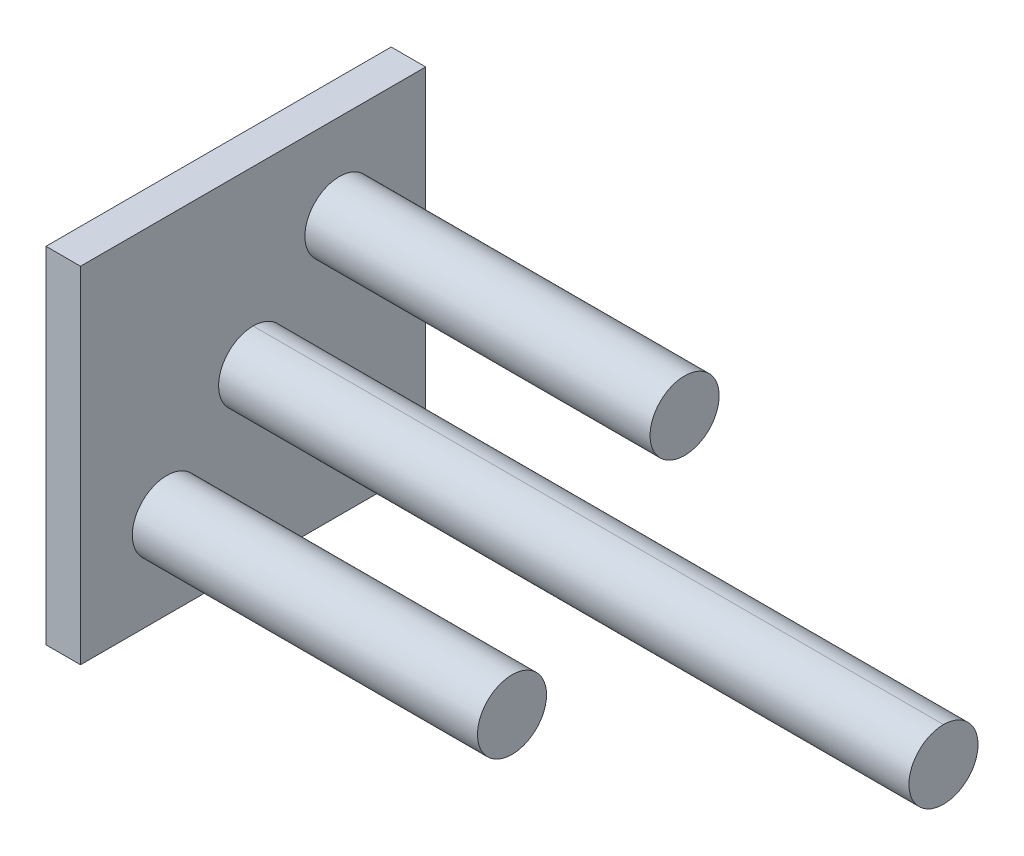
ISO-10303-21;
HEADER;
FILE_DESCRIPTION(('STEP AP214'),'2;1');
FILE_NAME('part.step','',(''),(''),'','','');
FILE_SCHEMA(('AUTOMOTIVE_DESIGN { 1 0 10303 214 1 1 1 1 }'));
ENDSEC;
DATA;
#1=APPLICATION_CONTEXT('core data for automotive mechanical design processes');
#2=APPLICATION_PROTOCOL_DEFINITION('international standard','automotive_design',2000,#1);
#3=PRODUCT_CONTEXT('',#1,'mechanical');
#4=PRODUCT('Part','Part','',(#3));
#5=PRODUCT_RELATED_PRODUCT_CATEGORY('part','',(#4));
#6=PRODUCT_DEFINITION_FORMATION('','',#4);
#7=PRODUCT_DEFINITION_CONTEXT('part definition',#1,'design');
#8=PRODUCT_DEFINITION('design','',#6,#7);
#9=PRODUCT_DEFINITION_SHAPE('','',#8);
#10=(LENGTH_UNIT() NAMED_UNIT(*) SI_UNIT(.MILLI.,.METRE.));
#11=(NAMED_UNIT(*) PLANE_ANGLE_UNIT() SI_UNIT($,.RADIAN.));
#12=(NAMED_UNIT(*) SI_UNIT($,.STERADIAN.) SOLID_ANGLE_UNIT());
#13=UNCERTAINTY_MEASURE_WITH_UNIT(LENGTH_MEASURE(1.E-05),#10,'distance_accuracy_value','');
#14=(GEOMETRIC_REPRESENTATION_CONTEXT(3) GLOBAL_UNCERTAINTY_ASSIGNED_CONTEXT((#13)) GLOBAL_UNIT_ASSIGNED_CONTEXT((#10,
#11,#12)) REPRESENTATION_CONTEXT('',''));
#15=CARTESIAN_POINT('',(0.,0.,0.));
#16=DIRECTION('',(0.,0.,1.));
#17=DIRECTION('',(1.,0.,0.));
#18=AXIS2_PLACEMENT_3D('',#15,#16,#17);
#19=CARTESIAN_POINT('',(42.,0.,0.));
#20=DIRECTION('',(-1.,0.,0.));
#21=DIRECTION('',(0.,0.,1.));
#22=AXIS2_PLACEMENT_3D('',#19,#20,#21);
#23=CYLINDRICAL_SURFACE('',#22,2.);
#24=CARTESIAN_POINT('',(42.,0.,0.));
#25=DIRECTION('',(1.,0.,0.));
#26=DIRECTION('',(0.,0.,-1.));
#27=AXIS2_PLACEMENT_3D('',#24,#25,#26);
#28=CIRCLE('',#27,2.);
#29=CARTESIAN_POINT('',(42.,-2.,0.));
#30=VERTEX_POINT('',#29);
#31=CARTESIAN_POINT('',(42.,2.,0.));
#32=VERTEX_POINT('',#31);
#33=EDGE_CURVE('E82',#30,#32,#28,.T.);
#34=ORIENTED_EDGE('',*,*,#33,.F.);
#35=DIRECTION('',(-1.,0.,0.));
#36=VECTOR('',#35,1.);
#37=CARTESIAN_POINT('',(42.,-2.,0.));
#38=LINE('',#37,#36);
#39=CARTESIAN_POINT('',(2.,-2.,0.));
#40=VERTEX_POINT('',#39);
#41=EDGE_CURVE('E12',#30,#40,#38,.T.);
#42=ORIENTED_EDGE('',*,*,#41,.T.);
#43=CARTESIAN_POINT('',(2.,0.,0.));
#44=DIRECTION('',(1.,0.,0.));
#45=DIRECTION('',(0.,0.,-1.));
#46=AXIS2_PLACEMENT_3D('',#43,#44,#45);
#47=CIRCLE('',#46,2.);
#48=CARTESIAN_POINT('',(2.,2.,0.));
#49=VERTEX_POINT('',#48);
#50=EDGE_CURVE('E89',#40,#49,#47,.T.);
#51=ORIENTED_EDGE('',*,*,#50,.T.);
#52=DIRECTION('',(1.,0.,0.));
#53=VECTOR('',#52,1.);
#54=CARTESIAN_POINT('',(42.,2.,0.));
#55=LINE('',#54,#53);
#56=EDGE_CURVE('E65',#49,#32,#55,.T.);
#57=ORIENTED_EDGE('',*,*,#56,.T.);
#58=EDGE_LOOP('',(#34,#42,#51,#57));
#59=FACE_BOUND('',#58,.T.);
#60=ADVANCED_FACE('F56',(#59),#23,.T.);
#61=ORIENTED_EDGE('',*,*,#41,.F.);
#62=EDGE_CURVE('E85',#32,#30,#28,.T.);
#63=ORIENTED_EDGE('',*,*,#62,.F.);
#64=ORIENTED_EDGE('',*,*,#56,.F.);
#65=EDGE_CURVE('E86',#49,#40,#47,.T.);
#66=ORIENTED_EDGE('',*,*,#65,.T.);
#67=EDGE_LOOP('',(#61,#63,#64,#66));
#68=FACE_BOUND('',#67,.T.);
#69=ADVANCED_FACE('F58',(#68),#23,.T.);
#70=CARTESIAN_POINT('',(42.,0.,0.));
#71=DIRECTION('',(1.,0.,0.));
#72=DIRECTION('',(0.,0.,-1.));
#73=AXIS2_PLACEMENT_3D('',#70,#71,#72);
#74=PLANE('',#73);
#75=ORIENTED_EDGE('',*,*,#62,.T.);
#76=ORIENTED_EDGE('',*,*,#33,.T.);
#77=EDGE_LOOP('',(#75,#76));
#78=FACE_BOUND('',#77,.T.);
#79=ADVANCED_FACE('F84',(#78),#74,.T.);
#80=CARTESIAN_POINT('',(2.,0.,0.));
#81=DIRECTION('',(1.,0.,0.));
#82=DIRECTION('',(0.,0.,-1.));
#83=AXIS2_PLACEMENT_3D('',#80,#81,#82);
#84=PLANE('',#83);
#85=ORIENTED_EDGE('',*,*,#65,.F.);
#86=ORIENTED_EDGE('',*,*,#50,.F.);
#87=EDGE_LOOP('',(#85,#86));
#88=FACE_BOUND('',#87,.T.);
#89=ADVANCED_FACE('F94',(#88),#84,.F.);
#90=CLOSED_SHELL('',(#60,#69,#79,#89));
#91=MANIFOLD_SOLID_BREP('B2',#90);
#92=CARTESIAN_POINT('',(2.,-10.,10.));
#93=DIRECTION('',(0.,0.,-1.));
#94=DIRECTION('',(0.,1.,0.));
#95=AXIS2_PLACEMENT_3D('',#92,#93,#94);
#96=PLANE('',#95);
#97=DIRECTION('',(0.,-1.,0.));
#98=VECTOR('',#97,1.);
#99=CARTESIAN_POINT('',(0.,-10.,10.));
#100=LINE('',#99,#98);
#101=CARTESIAN_POINT('',(0.,10.,10.));
#102=VERTEX_POINT('',#101);
#103=CARTESIAN_POINT('',(0.,-10.,10.));
#104=VERTEX_POINT('',#103);
#105=EDGE_CURVE('E230',#102,#104,#100,.T.);
#106=ORIENTED_EDGE('',*,*,#105,.T.);
#107=DIRECTION('',(-1.,0.,0.));
#108=VECTOR('',#107,1.);
#109=CARTESIAN_POINT('',(2.,-10.,10.));
#110=LINE('',#109,#108);
#111=CARTESIAN_POINT('',(2.,-10.,10.));
#112=VERTEX_POINT('',#111);
#113=EDGE_CURVE('E54',#112,#104,#110,.T.);
#114=ORIENTED_EDGE('',*,*,#113,.F.);
#115=DIRECTION('',(0.,-1.,0.));
#116=VECTOR('',#115,1.);
#117=CARTESIAN_POINT('',(2.,-10.,10.));
#118=LINE('',#117,#116);
#119=CARTESIAN_POINT('',(2.,10.,10.));
#120=VERTEX_POINT('',#119);
#121=EDGE_CURVE('E214',#120,#112,#118,.T.);
#122=ORIENTED_EDGE('',*,*,#121,.F.);
#123=DIRECTION('',(-1.,0.,0.));
#124=VECTOR('',#123,1.);
#125=CARTESIAN_POINT('',(2.,10.,10.));
#126=LINE('',#125,#124);
#127=EDGE_CURVE('E226',#120,#102,#126,.T.);
#128=ORIENTED_EDGE('',*,*,#127,.T.);
#129=EDGE_LOOP('',(#106,#114,#122,#128));
#130=FACE_BOUND('',#129,.T.);
#131=ADVANCED_FACE('F162',(#130),#96,.F.);
#132=CARTESIAN_POINT('',(2.,-10.,-10.));
#133=DIRECTION('',(0.,1.,0.));
#134=DIRECTION('',(0.,0.,1.));
#135=AXIS2_PLACEMENT_3D('',#132,#133,#134);
#136=PLANE('',#135);
#137=DIRECTION('',(0.,0.,-1.));
#138=VECTOR('',#137,1.);
#139=CARTESIAN_POINT('',(0.,-10.,-10.));
#140=LINE('',#139,#138);
#141=CARTESIAN_POINT('',(0.,-10.,-10.));
#142=VERTEX_POINT('',#141);
#143=EDGE_CURVE('E219',#104,#142,#140,.T.);
#144=ORIENTED_EDGE('',*,*,#143,.T.);
#145=DIRECTION('',(-1.,0.,0.));
#146=VECTOR('',#145,1.);
#147=CARTESIAN_POINT('',(2.,-10.,-10.));
#148=LINE('',#147,#146);
#149=CARTESIAN_POINT('',(2.,-10.,-10.));
#150=VERTEX_POINT('',#149);
#151=EDGE_CURVE('E171',#150,#142,#148,.T.);
#152=ORIENTED_EDGE('',*,*,#151,.F.);
#153=DIRECTION('',(0.,0.,-1.));
#154=VECTOR('',#153,1.);
#155=CARTESIAN_POINT('',(2.,-10.,-10.));
#156=LINE('',#155,#154);
#157=EDGE_CURVE('E209',#112,#150,#156,.T.);
#158=ORIENTED_EDGE('',*,*,#157,.F.);
#159=ORIENTED_EDGE('',*,*,#113,.T.);
#160=EDGE_LOOP('',(#144,#152,#158,#159));
#161=FACE_BOUND('',#160,.T.);
#162=ADVANCED_FACE('F218',(#161),#136,.F.);
#163=CARTESIAN_POINT('',(2.,10.,-10.));
#164=DIRECTION('',(0.,0.,1.));
#165=DIRECTION('',(0.,-1.,0.));
#166=AXIS2_PLACEMENT_3D('',#163,#164,#165);
#167=PLANE('',#166);
#168=DIRECTION('',(0.,1.,0.));
#169=VECTOR('',#168,1.);
#170=CARTESIAN_POINT('',(0.,10.,-10.));
#171=LINE('',#170,#169);
#172=CARTESIAN_POINT('',(0.,10.,-10.));
#173=VERTEX_POINT('',#172);
#174=EDGE_CURVE('E196',#142,#173,#171,.T.);
#175=ORIENTED_EDGE('',*,*,#174,.T.);
#176=DIRECTION('',(-1.,0.,0.));
#177=VECTOR('',#176,1.);
#178=CARTESIAN_POINT('',(2.,10.,-10.));
#179=LINE('',#178,#177);
#180=CARTESIAN_POINT('',(2.,10.,-10.));
#181=VERTEX_POINT('',#180);
#182=EDGE_CURVE('E221',#181,#173,#179,.T.);
#183=ORIENTED_EDGE('',*,*,#182,.F.);
#184=DIRECTION('',(0.,1.,0.));
#185=VECTOR('',#184,1.);
#186=CARTESIAN_POINT('',(2.,10.,-10.));
#187=LINE('',#186,#185);
#188=EDGE_CURVE('E212',#150,#181,#187,.T.);
#189=ORIENTED_EDGE('',*,*,#188,.F.);
#190=ORIENTED_EDGE('',*,*,#151,.T.);
#191=EDGE_LOOP('',(#175,#183,#189,#190));
#192=FACE_BOUND('',#191,.T.);
#193=ADVANCED_FACE('F222',(#192),#167,.F.);
#194=CARTESIAN_POINT('',(2.,10.,10.));
#195=DIRECTION('',(0.,-1.,0.));
#196=DIRECTION('',(0.,0.,-1.));
#197=AXIS2_PLACEMENT_3D('',#194,#195,#196);
#198=PLANE('',#197);
#199=DIRECTION('',(0.,0.,1.));
#200=VECTOR('',#199,1.);
#201=CARTESIAN_POINT('',(0.,10.,10.));
#202=LINE('',#201,#200);
#203=EDGE_CURVE('E202',#173,#102,#202,.T.);
#204=ORIENTED_EDGE('',*,*,#203,.T.);
#205=ORIENTED_EDGE('',*,*,#127,.F.);
#206=DIRECTION('',(0.,0.,1.));
#207=VECTOR('',#206,1.);
#208=CARTESIAN_POINT('',(2.,10.,10.));
#209=LINE('',#208,#207);
#210=EDGE_CURVE('E179',#181,#120,#209,.T.);
#211=ORIENTED_EDGE('',*,*,#210,.F.);
#212=ORIENTED_EDGE('',*,*,#182,.T.);
#213=EDGE_LOOP('',(#204,#205,#211,#212));
#214=FACE_BOUND('',#213,.T.);
#215=ADVANCED_FACE('F243',(#214),#198,.F.);
#216=CARTESIAN_POINT('',(2.,0.,0.));
#217=DIRECTION('',(-1.,0.,0.));
#218=DIRECTION('',(0.,0.,1.));
#219=AXIS2_PLACEMENT_3D('',#216,#217,#218);
#220=PLANE('',#219);
#221=ORIENTED_EDGE('',*,*,#121,.T.);
#222=ORIENTED_EDGE('',*,*,#157,.T.);
#223=ORIENTED_EDGE('',*,*,#188,.T.);
#224=ORIENTED_EDGE('',*,*,#210,.T.);
#225=EDGE_LOOP('',(#221,#222,#223,#224));
#226=FACE_BOUND('',#225,.T.);
#227=ADVANCED_FACE('F210',(#226),#220,.F.);
#228=CARTESIAN_POINT('',(0.,0.,0.));
#229=DIRECTION('',(-1.,0.,0.));
#230=DIRECTION('',(0.,0.,1.));
#231=AXIS2_PLACEMENT_3D('',#228,#229,#230);
#232=PLANE('',#231);
#233=ORIENTED_EDGE('',*,*,#105,.F.);
#234=ORIENTED_EDGE('',*,*,#203,.F.);
#235=ORIENTED_EDGE('',*,*,#174,.F.);
#236=ORIENTED_EDGE('',*,*,#143,.F.);
#237=EDGE_LOOP('',(#233,#234,#235,#236));
#238=FACE_BOUND('',#237,.T.);
#239=ADVANCED_FACE('F246',(#238),#232,.T.);
#240=CLOSED_SHELL('',(#131,#162,#193,#215,#227,#239));
#241=MANIFOLD_SOLID_BREP('B6',#240);
#242=CARTESIAN_POINT('',(22.,-5.,5.));
#243=DIRECTION('',(-1.,0.,0.));
#244=DIRECTION('',(0.,0.,1.));
#245=AXIS2_PLACEMENT_3D('',#242,#243,#244);
#246=CYLINDRICAL_SURFACE('',#245,2.);
#247=CARTESIAN_POINT('',(22.,-5.,5.));
#248=DIRECTION('',(1.,0.,0.));
#249=DIRECTION('',(0.,0.,-1.));
#250=AXIS2_PLACEMENT_3D('',#247,#248,#249);
#251=CIRCLE('',#250,2.);
#252=CARTESIAN_POINT('',(22.,-5.,3.));
#253=VERTEX_POINT('',#252);
#254=EDGE_CURVE('E161',#253,#253,#251,.T.);
#255=ORIENTED_EDGE('',*,*,#254,.F.);
#256=EDGE_LOOP('',(#255));
#257=FACE_BOUND('',#256,.T.);
#258=CARTESIAN_POINT('',(2.,-5.,5.));
#259=DIRECTION('',(1.,0.,0.));
#260=DIRECTION('',(0.,0.,-1.));
#261=AXIS2_PLACEMENT_3D('',#258,#259,#260);
#262=CIRCLE('',#261,2.);
#263=CARTESIAN_POINT('',(2.,-5.,3.));
#264=VERTEX_POINT('',#263);
#265=EDGE_CURVE('E333',#264,#264,#262,.T.);
#266=ORIENTED_EDGE('',*,*,#265,.T.);
#267=EDGE_LOOP('',(#266));
#268=FACE_BOUND('',#267,.T.);
#269=ADVANCED_FACE('F330',(#257,#268),#246,.T.);
#270=CARTESIAN_POINT('',(22.,-5.,5.));
#271=DIRECTION('',(1.,0.,0.));
#272=DIRECTION('',(0.,0.,-1.));
#273=AXIS2_PLACEMENT_3D('',#270,#271,#272);
#274=PLANE('',#273);
#275=ORIENTED_EDGE('',*,*,#254,.T.);
#276=EDGE_LOOP('',(#275));
#277=FACE_BOUND('',#276,.T.);
#278=ADVANCED_FACE('F345',(#277),#274,.T.);
#279=CARTESIAN_POINT('',(2.,-5.,5.));
#280=DIRECTION('',(1.,0.,0.));
#281=DIRECTION('',(0.,0.,-1.));
#282=AXIS2_PLACEMENT_3D('',#279,#280,#281);
#283=PLANE('',#282);
#284=ORIENTED_EDGE('',*,*,#265,.F.);
#285=EDGE_LOOP('',(#284));
#286=FACE_BOUND('',#285,.T.);
#287=ADVANCED_FACE('F343',(#286),#283,.F.);
#288=CLOSED_SHELL('',(#269,#278,#287));
#289=MANIFOLD_SOLID_BREP('B48',#288);
#290=CARTESIAN_POINT('',(22.,5.,-5.));
#291=DIRECTION('',(-1.,0.,0.));
#292=DIRECTION('',(0.,0.,1.));
#293=AXIS2_PLACEMENT_3D('',#290,#291,#292);
#294=CYLINDRICAL_SURFACE('',#293,2.);
#295=CARTESIAN_POINT('',(22.,5.,-5.));
#296=DIRECTION('',(1.,0.,0.));
#297=DIRECTION('',(0.,0.,-1.));
#298=AXIS2_PLACEMENT_3D('',#295,#296,#297);
#299=CIRCLE('',#298,2.);
#300=CARTESIAN_POINT('',(22.,5.,-7.));
#301=VERTEX_POINT('',#300);
#302=EDGE_CURVE('E329',#301,#301,#299,.T.);
#303=ORIENTED_EDGE('',*,*,#302,.F.);
#304=EDGE_LOOP('',(#303));
#305=FACE_BOUND('',#304,.T.);
#306=CARTESIAN_POINT('',(2.,5.,-5.));
#307=DIRECTION('',(1.,0.,0.));
#308=DIRECTION('',(0.,0.,-1.));
#309=AXIS2_PLACEMENT_3D('',#306,#307,#308);
#310=CIRCLE('',#309,2.);
#311=CARTESIAN_POINT('',(2.,5.,-7.));
#312=VERTEX_POINT('',#311);
#313=EDGE_CURVE('E380',#312,#312,#310,.T.);
#314=ORIENTED_EDGE('',*,*,#313,.T.);
#315=EDGE_LOOP('',(#314));
#316=FACE_BOUND('',#315,.T.);
#317=ADVANCED_FACE('F377',(#305,#316),#294,.T.);
#318=CARTESIAN_POINT('',(22.,5.,-5.));
#319=DIRECTION('',(1.,0.,0.));
#320=DIRECTION('',(0.,0.,-1.));
#321=AXIS2_PLACEMENT_3D('',#318,#319,#320);
#322=PLANE('',#321);
#323=ORIENTED_EDGE('',*,*,#302,.T.);
#324=EDGE_LOOP('',(#323));
#325=FACE_BOUND('',#324,.T.);
#326=ADVANCED_FACE('F392',(#325),#322,.T.);
#327=CARTESIAN_POINT('',(2.,5.,-5.));
#328=DIRECTION('',(1.,0.,0.));
#329=DIRECTION('',(0.,0.,-1.));
#330=AXIS2_PLACEMENT_3D('',#327,#328,#329);
#331=PLANE('',#330);
#332=ORIENTED_EDGE('',*,*,#313,.F.);
#333=EDGE_LOOP('',(#332));
#334=FACE_BOUND('',#333,.T.);
#335=ADVANCED_FACE('F390',(#334),#331,.F.);
#336=CLOSED_SHELL('',(#317,#326,#335));
#337=MANIFOLD_SOLID_BREP('B156',#336);
#338=CARTESIAN_POINT('',(22.,-5.,-5.));
#339=DIRECTION('',(-1.,0.,0.));
#340=DIRECTION('',(0.,0.,1.));
#341=AXIS2_PLACEMENT_3D('',#338,#339,#340);
#342=CYLINDRICAL_SURFACE('',#341,2.);
#343=CARTESIAN_POINT('',(22.,-5.,-5.));
#344=DIRECTION('',(1.,0.,0.));
#345=DIRECTION('',(0.,0.,-1.));
#346=AXIS2_PLACEMENT_3D('',#343,#344,#345);
#347=CIRCLE('',#346,2.);
#348=CARTESIAN_POINT('',(22.,-5.,-7.));
#349=VERTEX_POINT('',#348);
#350=EDGE_CURVE('E376',#349,#349,#347,.T.);
#351=ORIENTED_EDGE('',*,*,#350,.F.);
#352=EDGE_LOOP('',(#351));
#353=FACE_BOUND('',#352,.T.);
#354=CARTESIAN_POINT('',(2.,-5.,-5.));
#355=DIRECTION('',(1.,0.,0.));
#356=DIRECTION('',(0.,0.,-1.));
#357=AXIS2_PLACEMENT_3D('',#354,#355,#356);
#358=CIRCLE('',#357,2.);
#359=CARTESIAN_POINT('',(2.,-5.,-7.));
#360=VERTEX_POINT('',#359);
#361=EDGE_CURVE('E420',#360,#360,#358,.T.);
#362=ORIENTED_EDGE('',*,*,#361,.T.);
#363=EDGE_LOOP('',(#362));
#364=FACE_BOUND('',#363,.T.);
#365=ADVANCED_FACE('F417',(#353,#364),#342,.T.);
#366=CARTESIAN_POINT('',(22.,-5.,-5.));
#367=DIRECTION('',(1.,0.,0.));
#368=DIRECTION('',(0.,0.,-1.));
#369=AXIS2_PLACEMENT_3D('',#366,#367,#368);
#370=PLANE('',#369);
#371=ORIENTED_EDGE('',*,*,#350,.T.);
#372=EDGE_LOOP('',(#371));
#373=FACE_BOUND('',#372,.T.);
#374=ADVANCED_FACE('F432',(#373),#370,.T.);
#375=CARTESIAN_POINT('',(2.,-5.,-5.));
#376=DIRECTION('',(1.,0.,0.));
#377=DIRECTION('',(0.,0.,-1.));
#378=AXIS2_PLACEMENT_3D('',#375,#376,#377);
#379=PLANE('',#378);
#380=ORIENTED_EDGE('',*,*,#361,.F.);
#381=EDGE_LOOP('',(#380));
#382=FACE_BOUND('',#381,.T.);
#383=ADVANCED_FACE('F430',(#382),#379,.F.);
#384=CLOSED_SHELL('',(#365,#374,#383));
#385=MANIFOLD_SOLID_BREP('B324',#384);
#386=ADVANCED_BREP_SHAPE_REPRESENTATION('',(#18,#91,#241,#289,#337,#385),#14);
#387=SHAPE_DEFINITION_REPRESENTATION(#9,#386);
ENDSEC;
END-ISO-10303-21;
